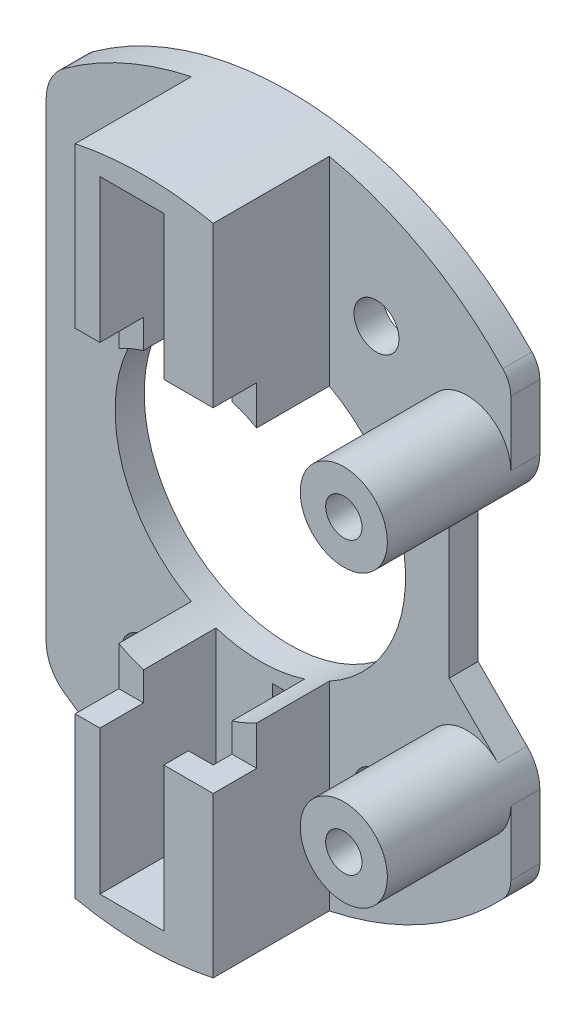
from build123d import *

# Parameters (mm, degrees)
ESQUISSE2_R             = 1.55
ESQUISSE2_R_2           = 10
ESQUISSE2_W             = 2.2
ESQUISSE2_H             = 10.5
BASE_EXTRUSION_DEPTH    = 2
ESQUISSE3_R             = 3
BOSS_EXTRU_1_DEPTH      = 8.5
BOSS_EXTRU_4_DEPTH      = 8
ESQUISSE9_W             = 1.7
ESQUISSE9_H             = 9.9
BOSS_EXTRU_6_DEPTH      = 1.7
ESQUISSE10_W            = 18.176300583
ESQUISSE10_H            = 23
ENL_V_MAT_EXTRU_1_DEPTH = 3
ESQUISSE11_R            = 1.25
ENL_V_MAT_EXTRU_2_DEPTH = 52.869692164


with BuildPart() as part:
    # Esquisse2 → Base-Extrusion (new body)
    with BuildSketch(Plane.XY):
        with BuildLine():
            Line((-14.75, 40.961595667), (-14.75, 8.592629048))
            ThreePointArc((-14.75, 8.592629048), (-14.422779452, 7.230186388), (-13.5125, 6.164956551))
            ThreePointArc((-13.5125, 6.164956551), (2.122159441, 1.875225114), (16.702380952, 8.964760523))
            ThreePointArc((16.702380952, 8.964760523), (17.108058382, 9.59973477), (17.25, 10.339747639))
            Line((17.25, 10.339747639), (17.25, 14.78447167))
            ThreePointArc((17.25, 14.78447167), (17.021638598, 15.932521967), (16.371320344, 16.905792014))
            Line((16.371320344, 16.905792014), (13, 20.277112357))
            Line((13, 20.277112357), (13, 29.277112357))
            Line((13, 29.277112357), (16.371320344, 32.648432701))
            ThreePointArc((16.371320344, 32.648432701), (17.021638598, 33.621702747), (17.25, 34.769753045))
            Line((17.25, 34.769753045), (17.25, 39.214477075))
            ThreePointArc((17.25, 39.214477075), (17.108058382, 39.954489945), (16.702380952, 40.589464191))
            ThreePointArc((16.702380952, 40.589464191), (2.122159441, 47.678999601), (-13.5125, 43.389268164))
            ThreePointArc((-13.5125, 43.389268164), (-14.422779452, 42.324038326), (-14.75, 40.961595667))
        make_face()
        with Locations((-8, 38.777112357)):
            Circle(ESQUISSE2_R, mode=Mode.SUBTRACT)
        with Locations((8, 38.777112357)):
            Circle(ESQUISSE2_R, mode=Mode.SUBTRACT)
        with Locations((8, 10.777112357)):
            Circle(ESQUISSE2_R, mode=Mode.SUBTRACT)
        with Locations((-8, 10.777112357)):
            Circle(ESQUISSE2_R, mode=Mode.SUBTRACT)
        with Locations(Location((0, 24.777112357, 0), (0, 0, 241.640649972))):
            Circle(ESQUISSE2_R_2, mode=Mode.SUBTRACT)
        with Locations((1.95, 40.927112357)):
            Rectangle(ESQUISSE2_W, ESQUISSE2_H, mode=Mode.SUBTRACT)
        with Locations((1.95, 8.627112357)):
            Rectangle(ESQUISSE2_W, ESQUISSE2_H, mode=Mode.SUBTRACT)
    extrude(amount=BASE_EXTRUSION_DEPTH)

    # Esquisse3 → Boss.-Extru.1 (add)
    with BuildSketch(Plane.XY.offset(2)):
        with Locations((14.25, 34.769753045)):
            Circle(ESQUISSE3_R)
        with Locations((14.25, 14.78447167)):
            Circle(ESQUISSE3_R)
    extrude(amount=BOSS_EXTRU_1_DEPTH)

    # Esquisse8 → Boss.-Extru.4 (add)
    with BuildSketch(Plane.XY.offset(2)):
        with BuildLine():
            Line((3.05, 46.177112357), (-3.05, 46.177112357))
            Line((-3.05, 46.177112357), (-3.05, 34.300635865))
            ThreePointArc((-3.05, 34.300635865), (-3.916749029, 33.978149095), (-4.75, 33.576970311))
            Line((-4.75, 33.576970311), (-4.75, 47.281278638))
            ThreePointArc((-4.75, 47.281278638), (0, 47.777112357), (4.75, 47.281278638))
            Line((4.75, 47.281278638), (4.75, 33.576970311))
            ThreePointArc((4.75, 33.576970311), (3.916749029, 33.978149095), (3.05, 34.300635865))
            Line((3.05, 34.300635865), (3.05, 46.177112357))
        make_face()
        with BuildLine():
            Line((4.75, 2.272946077), (4.75, 15.977254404))
            ThreePointArc((4.75, 15.977254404), (3.916749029, 15.57607562), (3.05, 15.25358885))
            Line((3.05, 15.25358885), (3.05, 3.377112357))
            Line((3.05, 3.377112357), (-3.05, 3.377112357))
            Line((-3.05, 3.377112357), (-3.05, 15.25358885))
            ThreePointArc((-3.05, 15.25358885), (-3.916749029, 15.57607562), (-4.75, 15.977254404))
            Line((-4.75, 15.977254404), (-4.75, 2.272946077))
            ThreePointArc((-4.75, 2.272946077), (0, 1.777112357), (4.75, 2.272946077))
        make_face()
    extrude(amount=BOSS_EXTRU_4_DEPTH)

    # Esquisse9 → Boss.-Extru.6 (add)
    with BuildSketch(Plane.XY.offset(10)):
        with Locations((2.2, 41.227112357)):
            Rectangle(ESQUISSE9_W, ESQUISSE9_H)
        with Locations((2.2, 8.327112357)):
            Rectangle(ESQUISSE9_W, ESQUISSE9_H)
    extrude(amount=-BOSS_EXTRU_6_DEPTH)

    # Esquisse10 → Enl_v. mat.-Extru.1 (cut)
    with BuildSketch(Plane.XY.offset(10)):
        with Locations((-1.042635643, 24.777112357)):
            Rectangle(ESQUISSE10_W, ESQUISSE10_H)
    extrude(amount=-ENL_V_MAT_EXTRU_1_DEPTH, mode=Mode.SUBTRACT)

    # Esquisse11 → Enl_v. mat.-Extru.2 (cut, through all)
    with BuildSketch(Plane.XY.offset(10.5)):
        with Locations((14.25, 34.769753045)):
            Circle(ESQUISSE11_R)
        with Locations((14.25, 14.78447167)):
            Circle(ESQUISSE11_R)
    extrude(amount=-ENL_V_MAT_EXTRU_2_DEPTH, mode=Mode.SUBTRACT)


solid = part.part
